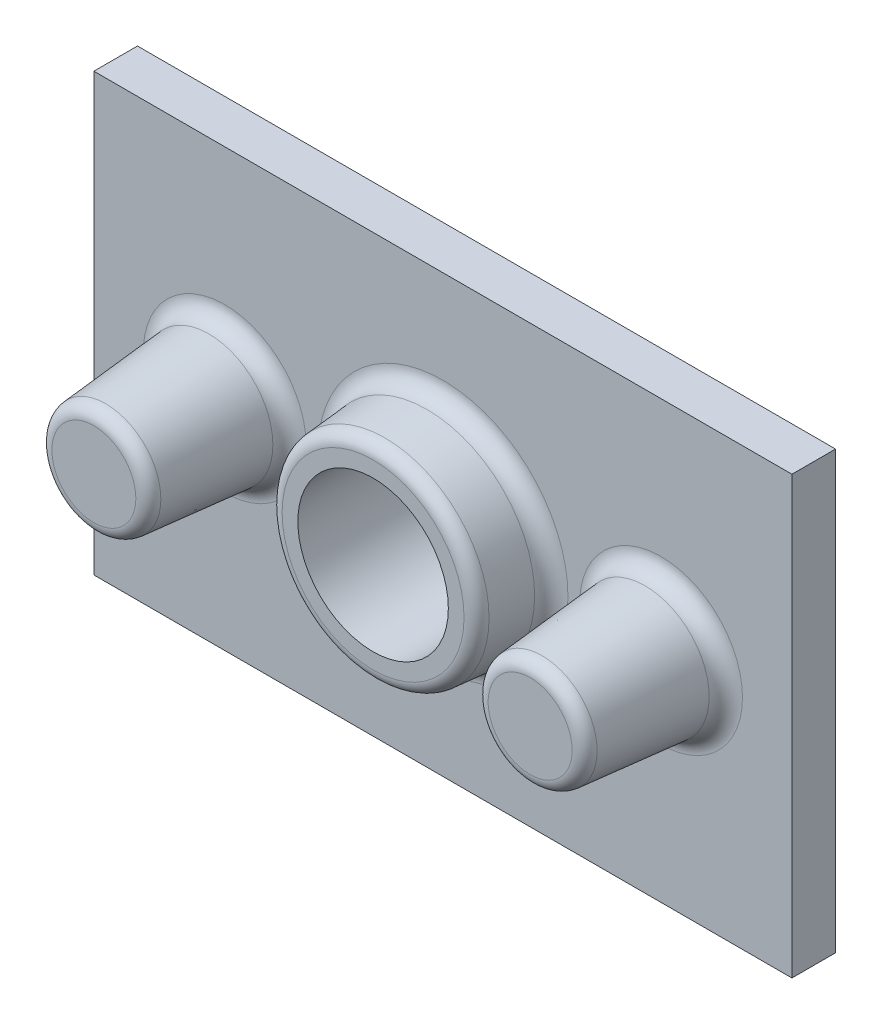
ISO-10303-21;
HEADER;
FILE_DESCRIPTION(('STEP AP214'),'2;1');
FILE_NAME('part.step','',(''),(''),'','','');
FILE_SCHEMA(('AUTOMOTIVE_DESIGN { 1 0 10303 214 1 1 1 1 }'));
ENDSEC;
DATA;
#1=APPLICATION_CONTEXT('core data for automotive mechanical design processes');
#2=APPLICATION_PROTOCOL_DEFINITION('international standard','automotive_design',2000,#1);
#3=PRODUCT_CONTEXT('',#1,'mechanical');
#4=PRODUCT('Part','Part','',(#3));
#5=PRODUCT_RELATED_PRODUCT_CATEGORY('part','',(#4));
#6=PRODUCT_DEFINITION_FORMATION('','',#4);
#7=PRODUCT_DEFINITION_CONTEXT('part definition',#1,'design');
#8=PRODUCT_DEFINITION('design','',#6,#7);
#9=PRODUCT_DEFINITION_SHAPE('','',#8);
#10=(LENGTH_UNIT() NAMED_UNIT(*) SI_UNIT(.MILLI.,.METRE.));
#11=(NAMED_UNIT(*) PLANE_ANGLE_UNIT() SI_UNIT($,.RADIAN.));
#12=(NAMED_UNIT(*) SI_UNIT($,.STERADIAN.) SOLID_ANGLE_UNIT());
#13=UNCERTAINTY_MEASURE_WITH_UNIT(LENGTH_MEASURE(1.E-05),#10,'distance_accuracy_value','');
#14=(GEOMETRIC_REPRESENTATION_CONTEXT(3) GLOBAL_UNCERTAINTY_ASSIGNED_CONTEXT((#13)) GLOBAL_UNIT_ASSIGNED_CONTEXT((#10,
#11,#12)) REPRESENTATION_CONTEXT('',''));
#15=CARTESIAN_POINT('',(0.,0.,0.));
#16=DIRECTION('',(0.,0.,1.));
#17=DIRECTION('',(1.,0.,0.));
#18=AXIS2_PLACEMENT_3D('',#15,#16,#17);
#19=CARTESIAN_POINT('',(-40.,25.,0.));
#20=DIRECTION('',(0.,0.,1.));
#21=DIRECTION('',(1.,0.,0.));
#22=AXIS2_PLACEMENT_3D('',#19,#20,#21);
#23=PLANE('',#22);
#24=CARTESIAN_POINT('',(0.,0.,0.));
#25=DIRECTION('',(0.,0.,1.));
#26=DIRECTION('',(1.,0.,0.));
#27=AXIS2_PLACEMENT_3D('',#24,#25,#26);
#28=CIRCLE('',#27,14.5);
#29=CARTESIAN_POINT('',(14.5,0.,0.));
#30=VERTEX_POINT('',#29);
#31=EDGE_CURVE('E205',#30,#30,#28,.T.);
#32=ORIENTED_EDGE('',*,*,#31,.T.);
#33=EDGE_LOOP('',(#32));
#34=FACE_BOUND('',#33,.T.);
#35=DIRECTION('',(0.,-1.,0.));
#36=VECTOR('',#35,1.);
#37=CARTESIAN_POINT('',(-40.,25.,0.));
#38=LINE('',#37,#36);
#39=CARTESIAN_POINT('',(-40.,25.,0.));
#40=VERTEX_POINT('',#39);
#41=CARTESIAN_POINT('',(-40.,-25.,0.));
#42=VERTEX_POINT('',#41);
#43=EDGE_CURVE('E136',#40,#42,#38,.T.);
#44=ORIENTED_EDGE('',*,*,#43,.F.);
#45=DIRECTION('',(-1.,0.,0.));
#46=VECTOR('',#45,1.);
#47=CARTESIAN_POINT('',(-40.,25.,0.));
#48=LINE('',#47,#46);
#49=CARTESIAN_POINT('',(40.,25.,0.));
#50=VERTEX_POINT('',#49);
#51=EDGE_CURVE('E89',#50,#40,#48,.T.);
#52=ORIENTED_EDGE('',*,*,#51,.F.);
#53=DIRECTION('',(0.,1.,0.));
#54=VECTOR('',#53,1.);
#55=CARTESIAN_POINT('',(40.,25.,0.));
#56=LINE('',#55,#54);
#57=CARTESIAN_POINT('',(40.,-25.,0.));
#58=VERTEX_POINT('',#57);
#59=EDGE_CURVE('E83',#58,#50,#56,.T.);
#60=ORIENTED_EDGE('',*,*,#59,.F.);
#61=DIRECTION('',(1.,0.,0.));
#62=VECTOR('',#61,1.);
#63=CARTESIAN_POINT('',(-40.,-25.,0.));
#64=LINE('',#63,#62);
#65=EDGE_CURVE('E146',#42,#58,#64,.T.);
#66=ORIENTED_EDGE('',*,*,#65,.F.);
#67=EDGE_LOOP('',(#44,#52,#60,#66));
#68=FACE_BOUND('',#67,.T.);
#69=CARTESIAN_POINT('',(25.,0.,0.));
#70=DIRECTION('',(0.,0.,1.));
#71=DIRECTION('',(1.,0.,0.));
#72=AXIS2_PLACEMENT_3D('',#69,#70,#71);
#73=CIRCLE('',#72,9.08266234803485);
#74=CARTESIAN_POINT('',(34.0826623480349,0.,0.));
#75=VERTEX_POINT('',#74);
#76=EDGE_CURVE('E196',#75,#75,#73,.T.);
#77=ORIENTED_EDGE('',*,*,#76,.T.);
#78=EDGE_LOOP('',(#77));
#79=FACE_BOUND('',#78,.T.);
#80=CARTESIAN_POINT('',(-25.,0.,0.));
#81=DIRECTION('',(0.,0.,1.));
#82=DIRECTION('',(1.,0.,0.));
#83=AXIS2_PLACEMENT_3D('',#80,#81,#82);
#84=CIRCLE('',#83,9.08266234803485);
#85=CARTESIAN_POINT('',(-15.9173376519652,0.,0.));
#86=VERTEX_POINT('',#85);
#87=EDGE_CURVE('E199',#86,#86,#84,.T.);
#88=ORIENTED_EDGE('',*,*,#87,.T.);
#89=EDGE_LOOP('',(#88));
#90=FACE_BOUND('',#89,.T.);
#91=ADVANCED_FACE('F48',(#34,#68,#79,#90),#23,.F.);
#92=CARTESIAN_POINT('',(-40.,25.,5.00000000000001));
#93=DIRECTION('',(0.,0.,1.));
#94=DIRECTION('',(1.,0.,0.));
#95=AXIS2_PLACEMENT_3D('',#92,#93,#94);
#96=PLANE('',#95);
#97=CARTESIAN_POINT('',(25.,0.,5.));
#98=DIRECTION('',(0.,0.,1.));
#99=DIRECTION('',(1.,0.,0.));
#100=AXIS2_PLACEMENT_3D('',#97,#98,#99);
#101=CIRCLE('',#100,9.33266234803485);
#102=CARTESIAN_POINT('',(34.3326623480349,0.,5.));
#103=VERTEX_POINT('',#102);
#104=EDGE_CURVE('E166',#103,#103,#101,.F.);
#105=ORIENTED_EDGE('',*,*,#104,.T.);
#106=EDGE_LOOP('',(#105));
#107=FACE_BOUND('',#106,.T.);
#108=CARTESIAN_POINT('',(0.,0.,5.));
#109=DIRECTION('',(0.,0.,1.));
#110=DIRECTION('',(1.,0.,0.));
#111=AXIS2_PLACEMENT_3D('',#108,#109,#110);
#112=CIRCLE('',#111,14.3326623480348);
#113=CARTESIAN_POINT('',(14.3326623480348,0.,5.));
#114=VERTEX_POINT('',#113);
#115=EDGE_CURVE('E163',#114,#114,#112,.F.);
#116=ORIENTED_EDGE('',*,*,#115,.T.);
#117=EDGE_LOOP('',(#116));
#118=FACE_BOUND('',#117,.T.);
#119=CARTESIAN_POINT('',(-25.,0.,5.));
#120=DIRECTION('',(0.,0.,1.));
#121=DIRECTION('',(1.,0.,0.));
#122=AXIS2_PLACEMENT_3D('',#119,#120,#121);
#123=CIRCLE('',#122,9.33266234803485);
#124=CARTESIAN_POINT('',(-15.6673376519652,0.,5.));
#125=VERTEX_POINT('',#124);
#126=EDGE_CURVE('E160',#125,#125,#123,.F.);
#127=ORIENTED_EDGE('',*,*,#126,.T.);
#128=EDGE_LOOP('',(#127));
#129=FACE_BOUND('',#128,.T.);
#130=DIRECTION('',(0.,-1.,0.));
#131=VECTOR('',#130,1.);
#132=CARTESIAN_POINT('',(-40.,25.,5.00000000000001));
#133=LINE('',#132,#131);
#134=CARTESIAN_POINT('',(-40.,25.,5.00000000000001));
#135=VERTEX_POINT('',#134);
#136=CARTESIAN_POINT('',(-40.,-25.,5.));
#137=VERTEX_POINT('',#136);
#138=EDGE_CURVE('E137',#135,#137,#133,.T.);
#139=ORIENTED_EDGE('',*,*,#138,.T.);
#140=DIRECTION('',(1.,0.,0.));
#141=VECTOR('',#140,1.);
#142=CARTESIAN_POINT('',(-40.,-25.,5.));
#143=LINE('',#142,#141);
#144=CARTESIAN_POINT('',(40.,-25.,4.99999999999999));
#145=VERTEX_POINT('',#144);
#146=EDGE_CURVE('E97',#137,#145,#143,.T.);
#147=ORIENTED_EDGE('',*,*,#146,.T.);
#148=DIRECTION('',(0.,1.,0.));
#149=VECTOR('',#148,1.);
#150=CARTESIAN_POINT('',(40.,25.,5.));
#151=LINE('',#150,#149);
#152=CARTESIAN_POINT('',(40.,25.,5.));
#153=VERTEX_POINT('',#152);
#154=EDGE_CURVE('E140',#145,#153,#151,.T.);
#155=ORIENTED_EDGE('',*,*,#154,.T.);
#156=DIRECTION('',(-1.,0.,0.));
#157=VECTOR('',#156,1.);
#158=CARTESIAN_POINT('',(-40.,25.,5.00000000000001));
#159=LINE('',#158,#157);
#160=EDGE_CURVE('E65',#153,#135,#159,.T.);
#161=ORIENTED_EDGE('',*,*,#160,.T.);
#162=EDGE_LOOP('',(#139,#147,#155,#161));
#163=FACE_BOUND('',#162,.T.);
#164=ADVANCED_FACE('F222',(#107,#118,#129,#163),#96,.T.);
#165=CARTESIAN_POINT('',(-40.,25.,5.00000000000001));
#166=DIRECTION('',(1.,0.,0.));
#167=DIRECTION('',(0.,1.,0.));
#168=AXIS2_PLACEMENT_3D('',#165,#166,#167);
#169=PLANE('',#168);
#170=ORIENTED_EDGE('',*,*,#43,.T.);
#171=DIRECTION('',(0.,0.,-1.));
#172=VECTOR('',#171,1.);
#173=CARTESIAN_POINT('',(-40.,-25.,5.));
#174=LINE('',#173,#172);
#175=EDGE_CURVE('E155',#137,#42,#174,.T.);
#176=ORIENTED_EDGE('',*,*,#175,.F.);
#177=ORIENTED_EDGE('',*,*,#138,.F.);
#178=DIRECTION('',(0.,0.,-1.));
#179=VECTOR('',#178,1.);
#180=CARTESIAN_POINT('',(-40.,25.,5.00000000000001));
#181=LINE('',#180,#179);
#182=EDGE_CURVE('E143',#135,#40,#181,.T.);
#183=ORIENTED_EDGE('',*,*,#182,.T.);
#184=EDGE_LOOP('',(#170,#176,#177,#183));
#185=FACE_BOUND('',#184,.T.);
#186=ADVANCED_FACE('F228',(#185),#169,.F.);
#187=CARTESIAN_POINT('',(-40.,-25.,5.));
#188=DIRECTION('',(0.,1.,0.));
#189=DIRECTION('',(-1.,0.,0.));
#190=AXIS2_PLACEMENT_3D('',#187,#188,#189);
#191=PLANE('',#190);
#192=ORIENTED_EDGE('',*,*,#65,.T.);
#193=DIRECTION('',(0.,0.,-1.));
#194=VECTOR('',#193,1.);
#195=CARTESIAN_POINT('',(40.,-25.,4.99999999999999));
#196=LINE('',#195,#194);
#197=EDGE_CURVE('E153',#145,#58,#196,.T.);
#198=ORIENTED_EDGE('',*,*,#197,.F.);
#199=ORIENTED_EDGE('',*,*,#146,.F.);
#200=ORIENTED_EDGE('',*,*,#175,.T.);
#201=EDGE_LOOP('',(#192,#198,#199,#200));
#202=FACE_BOUND('',#201,.T.);
#203=ADVANCED_FACE('F241',(#202),#191,.F.);
#204=CARTESIAN_POINT('',(40.,25.,5.));
#205=DIRECTION('',(-1.,0.,0.));
#206=DIRECTION('',(0.,0.,1.));
#207=AXIS2_PLACEMENT_3D('',#204,#205,#206);
#208=PLANE('',#207);
#209=ORIENTED_EDGE('',*,*,#59,.T.);
#210=DIRECTION('',(0.,0.,-1.));
#211=VECTOR('',#210,1.);
#212=CARTESIAN_POINT('',(40.,25.,5.));
#213=LINE('',#212,#211);
#214=EDGE_CURVE('E151',#153,#50,#213,.T.);
#215=ORIENTED_EDGE('',*,*,#214,.F.);
#216=ORIENTED_EDGE('',*,*,#154,.F.);
#217=ORIENTED_EDGE('',*,*,#197,.T.);
#218=EDGE_LOOP('',(#209,#215,#216,#217));
#219=FACE_BOUND('',#218,.T.);
#220=ADVANCED_FACE('F238',(#219),#208,.F.);
#221=CARTESIAN_POINT('',(-40.,25.,5.00000000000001));
#222=DIRECTION('',(0.,-1.,0.));
#223=DIRECTION('',(0.,0.,-1.));
#224=AXIS2_PLACEMENT_3D('',#221,#222,#223);
#225=PLANE('',#224);
#226=ORIENTED_EDGE('',*,*,#51,.T.);
#227=ORIENTED_EDGE('',*,*,#182,.F.);
#228=ORIENTED_EDGE('',*,*,#160,.F.);
#229=ORIENTED_EDGE('',*,*,#214,.T.);
#230=EDGE_LOOP('',(#226,#227,#228,#229));
#231=FACE_BOUND('',#230,.T.);
#232=ADVANCED_FACE('F234',(#231),#225,.F.);
#233=CARTESIAN_POINT('',(0.,0.,5.));
#234=DIRECTION('',(0.,0.,-1.));
#235=DIRECTION('',(1.,0.,0.));
#236=AXIS2_PLACEMENT_3D('',#233,#234,#235);
#237=CONICAL_SURFACE('',#236,12.5,0.0872664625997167);
#238=CARTESIAN_POINT('',(0.,0.,11.6307336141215));
#239=DIRECTION('',(0.,0.,-1.));
#240=DIRECTION('',(-1.,0.,0.));
#241=AXIS2_PLACEMENT_3D('',#238,#239,#240);
#242=CIRCLE('',#241,11.9198859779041);
#243=CARTESIAN_POINT('',(-11.9198859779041,0.,11.6307336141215));
#244=VERTEX_POINT('',#243);
#245=EDGE_CURVE('E184',#244,#244,#242,.T.);
#246=ORIENTED_EDGE('',*,*,#245,.T.);
#247=EDGE_LOOP('',(#246));
#248=FACE_BOUND('',#247,.T.);
#249=CARTESIAN_POINT('',(0.,0.,6.82568851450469));
#250=DIRECTION('',(0.,0.,1.));
#251=DIRECTION('',(1.,0.,0.));
#252=AXIS2_PLACEMENT_3D('',#249,#250,#251);
#253=CIRCLE('',#252,12.3402729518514);
#254=CARTESIAN_POINT('',(12.3402729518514,0.,6.82568851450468));
#255=VERTEX_POINT('',#254);
#256=EDGE_CURVE('E169',#255,#255,#253,.T.);
#257=ORIENTED_EDGE('',*,*,#256,.T.);
#258=EDGE_LOOP('',(#257));
#259=FACE_BOUND('',#258,.T.);
#260=ADVANCED_FACE('F237',(#248,#259),#237,.T.);
#261=CARTESIAN_POINT('',(0.,0.,13.));
#262=DIRECTION('',(0.,0.,1.));
#263=DIRECTION('',(1.,0.,0.));
#264=AXIS2_PLACEMENT_3D('',#261,#262,#263);
#265=PLANE('',#264);
#266=CARTESIAN_POINT('',(0.,0.,13.));
#267=DIRECTION('',(0.,0.,1.));
#268=DIRECTION('',(1.,0.,0.));
#269=AXIS2_PLACEMENT_3D('',#266,#267,#268);
#270=CIRCLE('',#269,8.625);
#271=CARTESIAN_POINT('',(8.625,0.,13.));
#272=VERTEX_POINT('',#271);
#273=EDGE_CURVE('E121',#272,#272,#270,.T.);
#274=ORIENTED_EDGE('',*,*,#273,.F.);
#275=EDGE_LOOP('',(#274));
#276=FACE_BOUND('',#275,.T.);
#277=CARTESIAN_POINT('',(0.,0.,13.));
#278=DIRECTION('',(0.,0.,1.));
#279=DIRECTION('',(1.,0.,0.));
#280=AXIS2_PLACEMENT_3D('',#277,#278,#279);
#281=CIRCLE('',#280,10.4255939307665);
#282=CARTESIAN_POINT('',(10.4255939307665,0.,13.));
#283=VERTEX_POINT('',#282);
#284=EDGE_CURVE('E181',#283,#283,#281,.T.);
#285=ORIENTED_EDGE('',*,*,#284,.T.);
#286=EDGE_LOOP('',(#285));
#287=FACE_BOUND('',#286,.T.);
#288=ADVANCED_FACE('F333',(#276,#287),#265,.T.);
#289=CARTESIAN_POINT('',(25.,0.,0.));
#290=DIRECTION('',(0.,0.,1.));
#291=DIRECTION('',(-1.,0.,0.));
#292=AXIS2_PLACEMENT_3D('',#289,#290,#291);
#293=CONICAL_SURFACE('',#292,7.25,0.0872664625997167);
#294=CARTESIAN_POINT('',(25.,0.,-1.82568851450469));
#295=DIRECTION('',(0.,0.,1.));
#296=DIRECTION('',(1.,0.,0.));
#297=AXIS2_PLACEMENT_3D('',#294,#295,#296);
#298=CIRCLE('',#297,7.09027295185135);
#299=CARTESIAN_POINT('',(32.0902729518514,0.,-1.82568851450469));
#300=VERTEX_POINT('',#299);
#301=EDGE_CURVE('E202',#300,#300,#298,.F.);
#302=ORIENTED_EDGE('',*,*,#301,.T.);
#303=EDGE_LOOP('',(#302));
#304=FACE_BOUND('',#303,.T.);
#305=CARTESIAN_POINT('',(25.,0.,-7.2));
#306=DIRECTION('',(0.,0.,-1.));
#307=DIRECTION('',(-1.,0.,0.));
#308=AXIS2_PLACEMENT_3D('',#305,#306,#307);
#309=CIRCLE('',#308,6.62008162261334);
#310=CARTESIAN_POINT('',(18.3799183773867,0.,-7.2));
#311=VERTEX_POINT('',#310);
#312=EDGE_CURVE('E133',#311,#311,#309,.T.);
#313=ORIENTED_EDGE('',*,*,#312,.F.);
#314=EDGE_LOOP('',(#313));
#315=FACE_BOUND('',#314,.T.);
#316=ADVANCED_FACE('F329',(#304,#315),#293,.T.);
#317=CARTESIAN_POINT('',(25.,0.,-7.2));
#318=DIRECTION('',(0.,0.,-1.));
#319=DIRECTION('',(-1.,0.,0.));
#320=AXIS2_PLACEMENT_3D('',#317,#318,#319);
#321=PLANE('',#320);
#322=CARTESIAN_POINT('',(25.,0.,-7.2));
#323=DIRECTION('',(0.,0.,-1.));
#324=DIRECTION('',(-1.,0.,0.));
#325=AXIS2_PLACEMENT_3D('',#322,#323,#324);
#326=CIRCLE('',#325,3.39999999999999);
#327=CARTESIAN_POINT('',(21.6,0.,-7.2));
#328=VERTEX_POINT('',#327);
#329=EDGE_CURVE('E127',#328,#328,#326,.T.);
#330=ORIENTED_EDGE('',*,*,#329,.F.);
#331=EDGE_LOOP('',(#330));
#332=FACE_BOUND('',#331,.T.);
#333=ORIENTED_EDGE('',*,*,#312,.T.);
#334=EDGE_LOOP('',(#333));
#335=FACE_BOUND('',#334,.T.);
#336=ADVANCED_FACE('F325',(#332,#335),#321,.T.);
#337=CARTESIAN_POINT('',(-25.,0.,0.));
#338=DIRECTION('',(0.,0.,1.));
#339=DIRECTION('',(-1.,0.,0.));
#340=AXIS2_PLACEMENT_3D('',#337,#338,#339);
#341=CONICAL_SURFACE('',#340,7.25,0.0872664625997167);
#342=CARTESIAN_POINT('',(-25.,0.,-1.82568851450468));
#343=DIRECTION('',(0.,0.,1.));
#344=DIRECTION('',(1.,0.,0.));
#345=AXIS2_PLACEMENT_3D('',#342,#343,#344);
#346=CIRCLE('',#345,7.09027295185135);
#347=CARTESIAN_POINT('',(-17.9097270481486,0.,-1.82568851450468));
#348=VERTEX_POINT('',#347);
#349=EDGE_CURVE('E193',#348,#348,#346,.F.);
#350=ORIENTED_EDGE('',*,*,#349,.T.);
#351=EDGE_LOOP('',(#350));
#352=FACE_BOUND('',#351,.T.);
#353=CARTESIAN_POINT('',(-25.,0.,-7.2));
#354=DIRECTION('',(0.,0.,-1.));
#355=DIRECTION('',(-1.,0.,0.));
#356=AXIS2_PLACEMENT_3D('',#353,#354,#355);
#357=CIRCLE('',#356,6.62008162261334);
#358=CARTESIAN_POINT('',(-31.6200816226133,0.,-7.2));
#359=VERTEX_POINT('',#358);
#360=EDGE_CURVE('E130',#359,#359,#357,.T.);
#361=ORIENTED_EDGE('',*,*,#360,.F.);
#362=EDGE_LOOP('',(#361));
#363=FACE_BOUND('',#362,.T.);
#364=ADVANCED_FACE('F321',(#352,#363),#341,.T.);
#365=CARTESIAN_POINT('',(-25.,0.,-7.2));
#366=DIRECTION('',(0.,0.,-1.));
#367=DIRECTION('',(-1.,0.,0.));
#368=AXIS2_PLACEMENT_3D('',#365,#366,#367);
#369=PLANE('',#368);
#370=CARTESIAN_POINT('',(-25.,0.,-7.2));
#371=DIRECTION('',(0.,0.,-1.));
#372=DIRECTION('',(-1.,0.,0.));
#373=AXIS2_PLACEMENT_3D('',#370,#371,#372);
#374=CIRCLE('',#373,3.39999999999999);
#375=CARTESIAN_POINT('',(-28.4,0.,-7.2));
#376=VERTEX_POINT('',#375);
#377=EDGE_CURVE('E114',#376,#376,#374,.T.);
#378=ORIENTED_EDGE('',*,*,#377,.F.);
#379=EDGE_LOOP('',(#378));
#380=FACE_BOUND('',#379,.T.);
#381=ORIENTED_EDGE('',*,*,#360,.T.);
#382=EDGE_LOOP('',(#381));
#383=FACE_BOUND('',#382,.T.);
#384=ADVANCED_FACE('F317',(#380,#383),#369,.T.);
#385=CARTESIAN_POINT('',(-25.,0.,5.));
#386=DIRECTION('',(0.,0.,-1.));
#387=DIRECTION('',(1.,0.,0.));
#388=AXIS2_PLACEMENT_3D('',#385,#386,#387);
#389=CONICAL_SURFACE('',#388,7.5,0.0872664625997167);
#390=CARTESIAN_POINT('',(-25.,0.,18.6307336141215));
#391=DIRECTION('',(0.,0.,-1.));
#392=DIRECTION('',(-1.,0.,0.));
#393=AXIS2_PLACEMENT_3D('',#390,#391,#392);
#394=CIRCLE('',#393,6.30746533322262);
#395=CARTESIAN_POINT('',(-31.3074653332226,0.,18.6307336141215));
#396=VERTEX_POINT('',#395);
#397=EDGE_CURVE('E190',#396,#396,#394,.T.);
#398=ORIENTED_EDGE('',*,*,#397,.T.);
#399=EDGE_LOOP('',(#398));
#400=FACE_BOUND('',#399,.T.);
#401=CARTESIAN_POINT('',(-25.,0.,6.82568851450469));
#402=DIRECTION('',(0.,0.,1.));
#403=DIRECTION('',(1.,0.,0.));
#404=AXIS2_PLACEMENT_3D('',#401,#402,#403);
#405=CIRCLE('',#404,7.34027295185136);
#406=CARTESIAN_POINT('',(-17.6597270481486,0.,6.82568851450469));
#407=VERTEX_POINT('',#406);
#408=EDGE_CURVE('E172',#407,#407,#405,.T.);
#409=ORIENTED_EDGE('',*,*,#408,.T.);
#410=EDGE_LOOP('',(#409));
#411=FACE_BOUND('',#410,.T.);
#412=ADVANCED_FACE('F313',(#400,#411),#389,.T.);
#413=CARTESIAN_POINT('',(-25.,0.,20.));
#414=DIRECTION('',(0.,0.,1.));
#415=DIRECTION('',(1.,0.,0.));
#416=AXIS2_PLACEMENT_3D('',#413,#414,#415);
#417=PLANE('',#416);
#418=CARTESIAN_POINT('',(-25.,0.,20.));
#419=DIRECTION('',(0.,0.,1.));
#420=DIRECTION('',(1.,0.,0.));
#421=AXIS2_PLACEMENT_3D('',#418,#419,#420);
#422=CIRCLE('',#421,4.813173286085);
#423=CARTESIAN_POINT('',(-20.186826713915,0.,20.));
#424=VERTEX_POINT('',#423);
#425=EDGE_CURVE('E187',#424,#424,#422,.T.);
#426=ORIENTED_EDGE('',*,*,#425,.T.);
#427=EDGE_LOOP('',(#426));
#428=FACE_BOUND('',#427,.T.);
#429=ADVANCED_FACE('F309',(#428),#417,.T.);
#430=CARTESIAN_POINT('',(25.,0.,5.));
#431=DIRECTION('',(0.,0.,-1.));
#432=DIRECTION('',(1.,0.,0.));
#433=AXIS2_PLACEMENT_3D('',#430,#431,#432);
#434=CONICAL_SURFACE('',#433,7.5,0.0872664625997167);
#435=CARTESIAN_POINT('',(25.,0.,18.6307336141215));
#436=DIRECTION('',(0.,0.,-1.));
#437=DIRECTION('',(-1.,0.,0.));
#438=AXIS2_PLACEMENT_3D('',#435,#436,#437);
#439=CIRCLE('',#438,6.30746533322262);
#440=CARTESIAN_POINT('',(18.6925346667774,0.,18.6307336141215));
#441=VERTEX_POINT('',#440);
#442=EDGE_CURVE('E178',#441,#441,#439,.T.);
#443=ORIENTED_EDGE('',*,*,#442,.T.);
#444=EDGE_LOOP('',(#443));
#445=FACE_BOUND('',#444,.T.);
#446=CARTESIAN_POINT('',(25.,0.,6.82568851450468));
#447=DIRECTION('',(0.,0.,1.));
#448=DIRECTION('',(1.,0.,0.));
#449=AXIS2_PLACEMENT_3D('',#446,#447,#448);
#450=CIRCLE('',#449,7.34027295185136);
#451=CARTESIAN_POINT('',(32.3402729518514,0.,6.82568851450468));
#452=VERTEX_POINT('',#451);
#453=EDGE_CURVE('E157',#452,#452,#450,.T.);
#454=ORIENTED_EDGE('',*,*,#453,.T.);
#455=EDGE_LOOP('',(#454));
#456=FACE_BOUND('',#455,.T.);
#457=ADVANCED_FACE('F305',(#445,#456),#434,.T.);
#458=CARTESIAN_POINT('',(25.,0.,20.));
#459=DIRECTION('',(0.,0.,1.));
#460=DIRECTION('',(1.,0.,0.));
#461=AXIS2_PLACEMENT_3D('',#458,#459,#460);
#462=PLANE('',#461);
#463=CARTESIAN_POINT('',(25.,0.,20.));
#464=DIRECTION('',(0.,0.,1.));
#465=DIRECTION('',(1.,0.,0.));
#466=AXIS2_PLACEMENT_3D('',#463,#464,#465);
#467=CIRCLE('',#466,4.813173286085);
#468=CARTESIAN_POINT('',(29.813173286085,0.,20.));
#469=VERTEX_POINT('',#468);
#470=EDGE_CURVE('E175',#469,#469,#467,.T.);
#471=ORIENTED_EDGE('',*,*,#470,.T.);
#472=EDGE_LOOP('',(#471));
#473=FACE_BOUND('',#472,.T.);
#474=ADVANCED_FACE('F251',(#473),#462,.T.);
#475=CARTESIAN_POINT('',(25.,0.,7.));
#476=DIRECTION('',(0.,0.,1.));
#477=DIRECTION('',(1.,0.,0.));
#478=AXIS2_PLACEMENT_3D('',#475,#476,#477);
#479=TOROIDAL_SURFACE('',#478,9.33266234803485,2.);
#480=ORIENTED_EDGE('',*,*,#104,.F.);
#481=EDGE_LOOP('',(#480));
#482=FACE_BOUND('',#481,.T.);
#483=ORIENTED_EDGE('',*,*,#453,.F.);
#484=EDGE_LOOP('',(#483));
#485=FACE_BOUND('',#484,.T.);
#486=ADVANCED_FACE('F247',(#482,#485),#479,.F.);
#487=CARTESIAN_POINT('',(0.,0.,7.));
#488=DIRECTION('',(0.,0.,1.));
#489=DIRECTION('',(1.,0.,0.));
#490=AXIS2_PLACEMENT_3D('',#487,#488,#489);
#491=TOROIDAL_SURFACE('',#490,14.3326623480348,2.);
#492=ORIENTED_EDGE('',*,*,#115,.F.);
#493=EDGE_LOOP('',(#492));
#494=FACE_BOUND('',#493,.T.);
#495=ORIENTED_EDGE('',*,*,#256,.F.);
#496=EDGE_LOOP('',(#495));
#497=FACE_BOUND('',#496,.T.);
#498=ADVANCED_FACE('F250',(#494,#497),#491,.F.);
#499=CARTESIAN_POINT('',(-25.,0.,7.));
#500=DIRECTION('',(0.,0.,1.));
#501=DIRECTION('',(1.,0.,0.));
#502=AXIS2_PLACEMENT_3D('',#499,#500,#501);
#503=TOROIDAL_SURFACE('',#502,9.33266234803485,2.);
#504=ORIENTED_EDGE('',*,*,#126,.F.);
#505=EDGE_LOOP('',(#504));
#506=FACE_BOUND('',#505,.T.);
#507=ORIENTED_EDGE('',*,*,#408,.F.);
#508=EDGE_LOOP('',(#507));
#509=FACE_BOUND('',#508,.T.);
#510=ADVANCED_FACE('F255',(#506,#509),#503,.F.);
#511=CARTESIAN_POINT('',(25.,0.,18.5));
#512=DIRECTION('',(0.,0.,1.));
#513=DIRECTION('',(1.,0.,0.));
#514=AXIS2_PLACEMENT_3D('',#511,#512,#513);
#515=TOROIDAL_SURFACE('',#514,4.813173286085,1.5);
#516=ORIENTED_EDGE('',*,*,#442,.F.);
#517=EDGE_LOOP('',(#516));
#518=FACE_BOUND('',#517,.T.);
#519=ORIENTED_EDGE('',*,*,#470,.F.);
#520=EDGE_LOOP('',(#519));
#521=FACE_BOUND('',#520,.T.);
#522=ADVANCED_FACE('F259',(#518,#521),#515,.T.);
#523=CARTESIAN_POINT('',(0.,0.,11.5));
#524=DIRECTION('',(0.,0.,1.));
#525=DIRECTION('',(1.,0.,0.));
#526=AXIS2_PLACEMENT_3D('',#523,#524,#525);
#527=TOROIDAL_SURFACE('',#526,10.4255939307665,1.5);
#528=ORIENTED_EDGE('',*,*,#245,.F.);
#529=EDGE_LOOP('',(#528));
#530=FACE_BOUND('',#529,.T.);
#531=ORIENTED_EDGE('',*,*,#284,.F.);
#532=EDGE_LOOP('',(#531));
#533=FACE_BOUND('',#532,.T.);
#534=ADVANCED_FACE('F263',(#530,#533),#527,.T.);
#535=CARTESIAN_POINT('',(-25.,0.,18.5));
#536=DIRECTION('',(0.,0.,1.));
#537=DIRECTION('',(1.,0.,0.));
#538=AXIS2_PLACEMENT_3D('',#535,#536,#537);
#539=TOROIDAL_SURFACE('',#538,4.813173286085,1.5);
#540=ORIENTED_EDGE('',*,*,#397,.F.);
#541=EDGE_LOOP('',(#540));
#542=FACE_BOUND('',#541,.T.);
#543=ORIENTED_EDGE('',*,*,#425,.F.);
#544=EDGE_LOOP('',(#543));
#545=FACE_BOUND('',#544,.T.);
#546=ADVANCED_FACE('F267',(#542,#545),#539,.T.);
#547=CARTESIAN_POINT('',(25.,0.,-7.2));
#548=DIRECTION('',(0.,0.,-1.));
#549=DIRECTION('',(-1.,0.,0.));
#550=AXIS2_PLACEMENT_3D('',#547,#548,#549);
#551=CYLINDRICAL_SURFACE('',#550,3.39999999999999);
#552=CARTESIAN_POINT('',(25.,0.,15.8));
#553=DIRECTION('',(0.,0.,-1.));
#554=DIRECTION('',(-1.,0.,0.));
#555=AXIS2_PLACEMENT_3D('',#552,#553,#554);
#556=CIRCLE('',#555,3.39999999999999);
#557=CARTESIAN_POINT('',(21.6,0.,15.8));
#558=VERTEX_POINT('',#557);
#559=EDGE_CURVE('E118',#558,#558,#556,.T.);
#560=ORIENTED_EDGE('',*,*,#559,.F.);
#561=EDGE_LOOP('',(#560));
#562=FACE_BOUND('',#561,.T.);
#563=ORIENTED_EDGE('',*,*,#329,.T.);
#564=EDGE_LOOP('',(#563));
#565=FACE_BOUND('',#564,.T.);
#566=ADVANCED_FACE('F271',(#562,#565),#551,.F.);
#567=CARTESIAN_POINT('',(25.,0.,15.8));
#568=DIRECTION('',(0.,0.,-1.));
#569=DIRECTION('',(-1.,0.,0.));
#570=AXIS2_PLACEMENT_3D('',#567,#568,#569);
#571=CONICAL_SURFACE('',#570,3.39999999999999,1.02974425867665);
#572=CARTESIAN_POINT('',(25.,0.,17.8429261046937));
#573=VERTEX_POINT('',#572);
#574=VERTEX_LOOP('',#573);
#575=FACE_BOUND('',#574,.T.);
#576=ORIENTED_EDGE('',*,*,#559,.T.);
#577=EDGE_LOOP('',(#576));
#578=FACE_BOUND('',#577,.T.);
#579=ADVANCED_FACE('F296',(#575,#578),#571,.F.);
#580=CARTESIAN_POINT('',(-25.,0.,-7.2));
#581=DIRECTION('',(0.,0.,-1.));
#582=DIRECTION('',(-1.,0.,0.));
#583=AXIS2_PLACEMENT_3D('',#580,#581,#582);
#584=CYLINDRICAL_SURFACE('',#583,3.39999999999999);
#585=CARTESIAN_POINT('',(-25.,0.,15.8));
#586=DIRECTION('',(0.,0.,-1.));
#587=DIRECTION('',(-1.,0.,0.));
#588=AXIS2_PLACEMENT_3D('',#585,#586,#587);
#589=CIRCLE('',#588,3.39999999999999);
#590=CARTESIAN_POINT('',(-28.4,0.,15.8));
#591=VERTEX_POINT('',#590);
#592=EDGE_CURVE('E112',#591,#591,#589,.T.);
#593=ORIENTED_EDGE('',*,*,#592,.F.);
#594=EDGE_LOOP('',(#593));
#595=FACE_BOUND('',#594,.T.);
#596=ORIENTED_EDGE('',*,*,#377,.T.);
#597=EDGE_LOOP('',(#596));
#598=FACE_BOUND('',#597,.T.);
#599=ADVANCED_FACE('F108',(#595,#598),#584,.F.);
#600=CARTESIAN_POINT('',(-25.,0.,15.8));
#601=DIRECTION('',(0.,0.,-1.));
#602=DIRECTION('',(-1.,0.,0.));
#603=AXIS2_PLACEMENT_3D('',#600,#601,#602);
#604=CONICAL_SURFACE('',#603,3.39999999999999,1.02974425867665);
#605=CARTESIAN_POINT('',(-25.,0.,17.8429261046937));
#606=VERTEX_POINT('',#605);
#607=VERTEX_LOOP('',#606);
#608=FACE_BOUND('',#607,.T.);
#609=ORIENTED_EDGE('',*,*,#592,.T.);
#610=EDGE_LOOP('',(#609));
#611=FACE_BOUND('',#610,.T.);
#612=ADVANCED_FACE('F104',(#608,#611),#604,.F.);
#613=CARTESIAN_POINT('',(-25.,0.,-2.));
#614=DIRECTION('',(0.,0.,1.));
#615=DIRECTION('',(1.,0.,0.));
#616=AXIS2_PLACEMENT_3D('',#613,#614,#615);
#617=TOROIDAL_SURFACE('',#616,9.08266234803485,2.);
#618=ORIENTED_EDGE('',*,*,#87,.F.);
#619=EDGE_LOOP('',(#618));
#620=FACE_BOUND('',#619,.T.);
#621=ORIENTED_EDGE('',*,*,#349,.F.);
#622=EDGE_LOOP('',(#621));
#623=FACE_BOUND('',#622,.T.);
#624=ADVANCED_FACE('F107',(#620,#623),#617,.F.);
#625=CARTESIAN_POINT('',(25.,0.,-2.));
#626=DIRECTION('',(0.,0.,1.));
#627=DIRECTION('',(1.,0.,0.));
#628=AXIS2_PLACEMENT_3D('',#625,#626,#627);
#629=TOROIDAL_SURFACE('',#628,9.08266234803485,2.);
#630=ORIENTED_EDGE('',*,*,#76,.F.);
#631=EDGE_LOOP('',(#630));
#632=FACE_BOUND('',#631,.T.);
#633=ORIENTED_EDGE('',*,*,#301,.F.);
#634=EDGE_LOOP('',(#633));
#635=FACE_BOUND('',#634,.T.);
#636=ADVANCED_FACE('F275',(#632,#635),#629,.F.);
#637=CARTESIAN_POINT('',(0.,0.,-2.));
#638=DIRECTION('',(0.,0.,-1.));
#639=DIRECTION('',(-1.,0.,0.));
#640=AXIS2_PLACEMENT_3D('',#637,#638,#639);
#641=PLANE('',#640);
#642=CARTESIAN_POINT('',(0.,0.,-2.));
#643=DIRECTION('',(0.,0.,-1.));
#644=DIRECTION('',(-1.,0.,0.));
#645=AXIS2_PLACEMENT_3D('',#642,#643,#644);
#646=CIRCLE('',#645,9.32499999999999);
#647=CARTESIAN_POINT('',(-9.32499999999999,0.,-2.));
#648=VERTEX_POINT('',#647);
#649=EDGE_CURVE('E13',#648,#648,#646,.F.);
#650=ORIENTED_EDGE('',*,*,#649,.T.);
#651=EDGE_LOOP('',(#650));
#652=FACE_BOUND('',#651,.T.);
#653=CARTESIAN_POINT('',(0.,0.,-2.));
#654=DIRECTION('',(0.,0.,-1.));
#655=DIRECTION('',(-1.,0.,0.));
#656=AXIS2_PLACEMENT_3D('',#653,#654,#655);
#657=CIRCLE('',#656,12.5);
#658=CARTESIAN_POINT('',(-12.5,0.,-2.));
#659=VERTEX_POINT('',#658);
#660=EDGE_CURVE('E115',#659,#659,#657,.T.);
#661=ORIENTED_EDGE('',*,*,#660,.T.);
#662=EDGE_LOOP('',(#661));
#663=FACE_BOUND('',#662,.T.);
#664=ADVANCED_FACE('F278',(#652,#663),#641,.T.);
#665=CARTESIAN_POINT('',(0.,0.,-2.));
#666=DIRECTION('',(0.,0.,1.));
#667=DIRECTION('',(1.,0.,0.));
#668=AXIS2_PLACEMENT_3D('',#665,#666,#667);
#669=TOROIDAL_SURFACE('',#668,14.5,2.);
#670=ORIENTED_EDGE('',*,*,#31,.F.);
#671=EDGE_LOOP('',(#670));
#672=FACE_BOUND('',#671,.T.);
#673=ORIENTED_EDGE('',*,*,#660,.F.);
#674=EDGE_LOOP('',(#673));
#675=FACE_BOUND('',#674,.T.);
#676=ADVANCED_FACE('F218',(#672,#675),#669,.F.);
#677=CARTESIAN_POINT('',(0.,0.,-7.2));
#678=DIRECTION('',(0.,0.,1.));
#679=DIRECTION('',(1.,0.,0.));
#680=AXIS2_PLACEMENT_3D('',#677,#678,#679);
#681=CYLINDRICAL_SURFACE('',#680,8.625);
#682=CARTESIAN_POINT('',(0.,0.,-1.30000000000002));
#683=DIRECTION('',(0.,0.,-1.));
#684=DIRECTION('',(-1.,0.,0.));
#685=AXIS2_PLACEMENT_3D('',#682,#683,#684);
#686=CIRCLE('',#685,8.625);
#687=CARTESIAN_POINT('',(-8.625,0.,-1.30000000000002));
#688=VERTEX_POINT('',#687);
#689=EDGE_CURVE('E57',#688,#688,#686,.T.);
#690=ORIENTED_EDGE('',*,*,#689,.T.);
#691=EDGE_LOOP('',(#690));
#692=FACE_BOUND('',#691,.T.);
#693=ORIENTED_EDGE('',*,*,#273,.T.);
#694=EDGE_LOOP('',(#693));
#695=FACE_BOUND('',#694,.T.);
#696=ADVANCED_FACE('F210',(#692,#695),#681,.F.);
#697=CARTESIAN_POINT('',(0.,0.,-1.30000000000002));
#698=DIRECTION('',(0.,0.,-1.));
#699=DIRECTION('',(-1.,0.,0.));
#700=AXIS2_PLACEMENT_3D('',#697,#698,#699);
#701=CONICAL_SURFACE('',#700,8.625,0.785398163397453);
#702=ORIENTED_EDGE('',*,*,#649,.F.);
#703=EDGE_LOOP('',(#702));
#704=FACE_BOUND('',#703,.T.);
#705=ORIENTED_EDGE('',*,*,#689,.F.);
#706=EDGE_LOOP('',(#705));
#707=FACE_BOUND('',#706,.T.);
#708=ADVANCED_FACE('F50',(#704,#707),#701,.F.);
#709=CLOSED_SHELL('',(#91,#164,#186,#203,#220,#232,#260,#288,#316,#336,#364,#384,#412,#429,#457,
#474,#486,#498,#510,#522,#534,#546,#566,#579,#599,#612,#624,#636,#664,#676,#696,#708));
#710=MANIFOLD_SOLID_BREP('B2',#709);
#711=ADVANCED_BREP_SHAPE_REPRESENTATION('',(#18,#710),#14);
#712=SHAPE_DEFINITION_REPRESENTATION(#9,#711);
ENDSEC;
END-ISO-10303-21;
